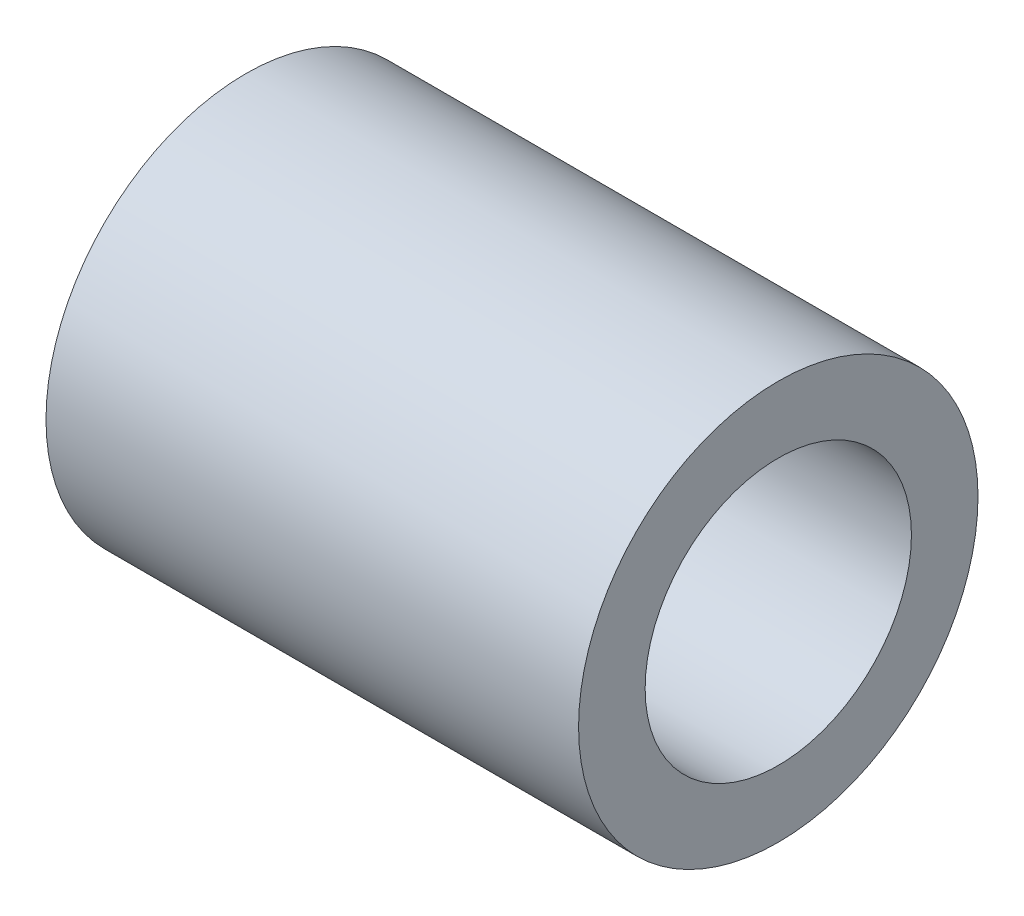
from build123d import *

# Parameters (mm, degrees)
SKETCH1_R           = 4.5
SKETCH1_R_2         = 3
BOSS_EXTRUDE1_DEPTH = 12


with BuildPart() as part:
    # Sketch1 → Boss-Extrude1 (new body)
    with BuildSketch(Plane(origin=(0, 0, 0), x_dir=(0, 0, -1), z_dir=(1, 0, 0))):
        Circle(SKETCH1_R)
        Circle(SKETCH1_R_2, mode=Mode.SUBTRACT)
    extrude(amount=BOSS_EXTRUDE1_DEPTH)


solid = part.part
